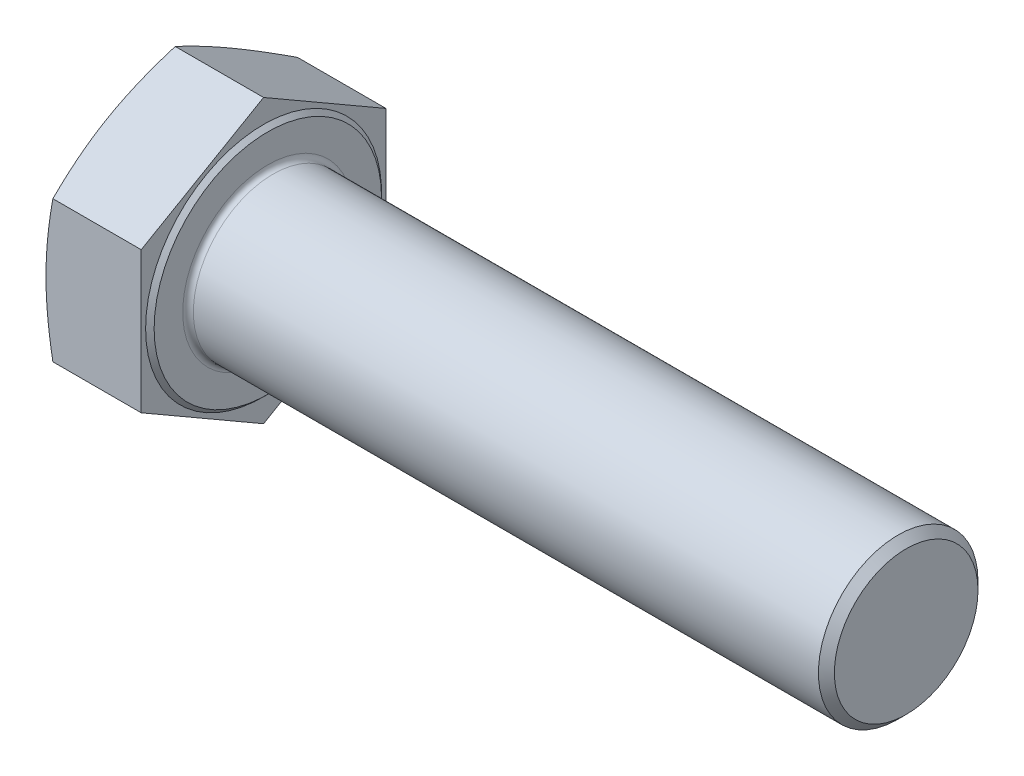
from build123d import *

# Parameters (mm, degrees)
BASEHEAD_DEPTH = 18.7
SKETCH5_R      = 15
BASEBODY_DEPTH = 120
CHAMFER1_SIZE  = 1.5
HEADFILLET_R   = 1


with BuildPart() as part:
    # Sketch2 → BaseHead (new body)
    with BuildSketch(Plane(origin=(0, 0, 0), x_dir=(0, 0, -1), z_dir=(1, 0, 0))):
        Polygon((0, -26.558112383), (23, -13.279056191), (23, 13.279056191), (0, 26.558112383), (-23, 13.279056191), (-23, -13.279056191), align=None)
    extrude(amount=BASEHEAD_DEPTH)

    # Sketch3 → BearingFace (revolve, cut)
    with BuildSketch(Plane.XY, mode=Mode.PRIVATE) as bearingface_sk:
        Polygon((18.7, 26.558112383), (18.7, 21.375), (17.9, 22.175), (17.9, 26.558112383), align=None)
    revolve(bearingface_sk.sketch.rotate(Axis((-0.957090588, 0, 0), (1, 0, 0)), 90), axis=Axis((-0.957090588, 0, 0), (1, 0, 0)), mode=Mode.SUBTRACT)

    # Sketch4 → HeadChamfer (revolve, cut)
    with BuildSketch(Plane.XY):
        Polygon((0, 26.558112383), (1.295046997, 26.558112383), (0, 23), align=None)
    revolve(axis=Axis((-0.493528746, 0, 0), (1, 0, 0)), mode=Mode.SUBTRACT)

    # Sketch5 → BaseBody (add)
    with BuildSketch(Plane(origin=(18.7, 0, 0), x_dir=(0, 0, -1), z_dir=(1, 0, 0))):
        Circle(SKETCH5_R)
    extrude(amount=BASEBODY_DEPTH)

    # Chamfer1
    chamfer1_edges = [part.edges().sort_by_distance(p)[0] for p in [
        (138.7, 0, 15),
    ]]
    chamfer(chamfer1_edges, length=CHAMFER1_SIZE)

    # HeadFillet
    headfillet_edges = [part.edges().sort_by_distance(p)[0] for p in [
        (18.7, 0, 15),
    ]]
    fillet(headfillet_edges, radius=HEADFILLET_R)


solid = part.part
